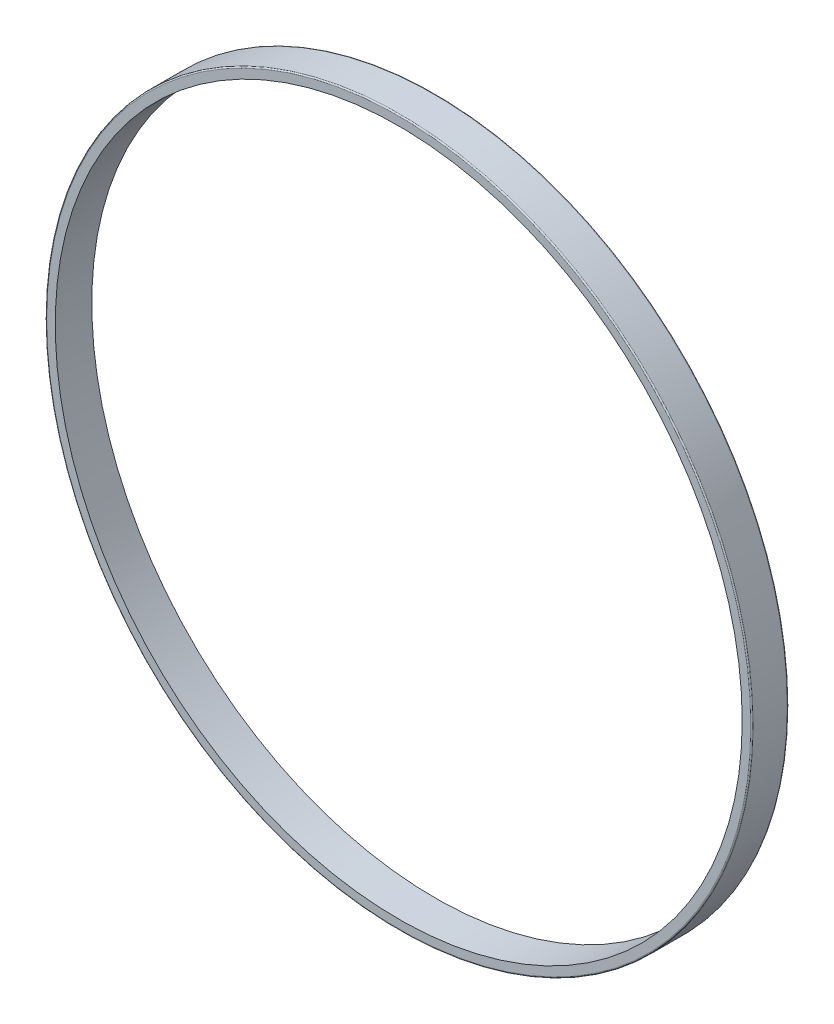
ISO-10303-21;
HEADER;
FILE_DESCRIPTION(('STEP AP214'),'2;1');
FILE_NAME('part.step','',(''),(''),'','','');
FILE_SCHEMA(('AUTOMOTIVE_DESIGN { 1 0 10303 214 1 1 1 1 }'));
ENDSEC;
DATA;
#1=APPLICATION_CONTEXT('core data for automotive mechanical design processes');
#2=APPLICATION_PROTOCOL_DEFINITION('international standard','automotive_design',2000,#1);
#3=PRODUCT_CONTEXT('',#1,'mechanical');
#4=PRODUCT('Part','Part','',(#3));
#5=PRODUCT_RELATED_PRODUCT_CATEGORY('part','',(#4));
#6=PRODUCT_DEFINITION_FORMATION('','',#4);
#7=PRODUCT_DEFINITION_CONTEXT('part definition',#1,'design');
#8=PRODUCT_DEFINITION('design','',#6,#7);
#9=PRODUCT_DEFINITION_SHAPE('','',#8);
#10=(LENGTH_UNIT() NAMED_UNIT(*) SI_UNIT(.MILLI.,.METRE.));
#11=(NAMED_UNIT(*) PLANE_ANGLE_UNIT() SI_UNIT($,.RADIAN.));
#12=(NAMED_UNIT(*) SI_UNIT($,.STERADIAN.) SOLID_ANGLE_UNIT());
#13=UNCERTAINTY_MEASURE_WITH_UNIT(LENGTH_MEASURE(1.E-05),#10,'distance_accuracy_value','');
#14=(GEOMETRIC_REPRESENTATION_CONTEXT(3) GLOBAL_UNCERTAINTY_ASSIGNED_CONTEXT((#13)) GLOBAL_UNIT_ASSIGNED_CONTEXT((#10,
#11,#12)) REPRESENTATION_CONTEXT('',''));
#15=CARTESIAN_POINT('',(0.,0.,0.));
#16=DIRECTION('',(0.,0.,1.));
#17=DIRECTION('',(1.,0.,0.));
#18=AXIS2_PLACEMENT_3D('',#15,#16,#17);
#19=CARTESIAN_POINT('',(0.,0.,6.));
#20=DIRECTION('',(0.,0.,1.));
#21=DIRECTION('',(1.,0.,0.));
#22=AXIS2_PLACEMENT_3D('',#19,#20,#21);
#23=PLANE('',#22);
#24=CARTESIAN_POINT('',(0.,0.,6.));
#25=DIRECTION('',(0.,0.,1.));
#26=DIRECTION('',(1.,0.,0.));
#27=AXIS2_PLACEMENT_3D('',#24,#25,#26);
#28=CIRCLE('',#27,57.8);
#29=CARTESIAN_POINT('',(57.8,0.,6.));
#30=VERTEX_POINT('',#29);
#31=EDGE_CURVE('E10',#30,#30,#28,.T.);
#32=ORIENTED_EDGE('',*,*,#31,.T.);
#33=EDGE_LOOP('',(#32));
#34=FACE_BOUND('',#33,.T.);
#35=CARTESIAN_POINT('',(0.,0.,6.));
#36=DIRECTION('',(0.,0.,1.));
#37=DIRECTION('',(1.,0.,0.));
#38=AXIS2_PLACEMENT_3D('',#35,#36,#37);
#39=CIRCLE('',#38,56.4);
#40=CARTESIAN_POINT('',(56.4,0.,6.));
#41=VERTEX_POINT('',#40);
#42=EDGE_CURVE('E53',#41,#41,#39,.T.);
#43=ORIENTED_EDGE('',*,*,#42,.F.);
#44=EDGE_LOOP('',(#43));
#45=FACE_BOUND('',#44,.T.);
#46=ADVANCED_FACE('F33',(#34,#45),#23,.T.);
#47=CARTESIAN_POINT('',(0.,0.,0.));
#48=DIRECTION('',(0.,0.,1.));
#49=DIRECTION('',(1.,0.,0.));
#50=AXIS2_PLACEMENT_3D('',#47,#48,#49);
#51=PLANE('',#50);
#52=CARTESIAN_POINT('',(0.,0.,0.));
#53=DIRECTION('',(0.,0.,1.));
#54=DIRECTION('',(1.,0.,0.));
#55=AXIS2_PLACEMENT_3D('',#52,#53,#54);
#56=CIRCLE('',#55,57.8);
#57=CARTESIAN_POINT('',(57.8,0.,0.));
#58=VERTEX_POINT('',#57);
#59=EDGE_CURVE('E40',#58,#58,#56,.F.);
#60=ORIENTED_EDGE('',*,*,#59,.T.);
#61=EDGE_LOOP('',(#60));
#62=FACE_BOUND('',#61,.T.);
#63=CARTESIAN_POINT('',(0.,0.,0.));
#64=DIRECTION('',(0.,0.,1.));
#65=DIRECTION('',(1.,0.,0.));
#66=AXIS2_PLACEMENT_3D('',#63,#64,#65);
#67=CIRCLE('',#66,56.4);
#68=CARTESIAN_POINT('',(56.4,0.,0.));
#69=VERTEX_POINT('',#68);
#70=EDGE_CURVE('E54',#69,#69,#67,.T.);
#71=ORIENTED_EDGE('',*,*,#70,.T.);
#72=EDGE_LOOP('',(#71));
#73=FACE_BOUND('',#72,.T.);
#74=ADVANCED_FACE('F64',(#62,#73),#51,.F.);
#75=CARTESIAN_POINT('',(0.,0.,6.));
#76=DIRECTION('',(0.,0.,-1.));
#77=DIRECTION('',(-1.,0.,0.));
#78=AXIS2_PLACEMENT_3D('',#75,#76,#77);
#79=CYLINDRICAL_SURFACE('',#78,58.);
#80=CARTESIAN_POINT('',(0.,0.,0.2));
#81=DIRECTION('',(0.,0.,1.));
#82=DIRECTION('',(1.,0.,0.));
#83=AXIS2_PLACEMENT_3D('',#80,#81,#82);
#84=CIRCLE('',#83,58.);
#85=CARTESIAN_POINT('',(58.,0.,0.2));
#86=VERTEX_POINT('',#85);
#87=EDGE_CURVE('E44',#86,#86,#84,.T.);
#88=ORIENTED_EDGE('',*,*,#87,.T.);
#89=EDGE_LOOP('',(#88));
#90=FACE_BOUND('',#89,.T.);
#91=CARTESIAN_POINT('',(0.,0.,5.8));
#92=DIRECTION('',(0.,0.,1.));
#93=DIRECTION('',(1.,0.,0.));
#94=AXIS2_PLACEMENT_3D('',#91,#92,#93);
#95=CIRCLE('',#94,58.);
#96=CARTESIAN_POINT('',(58.,0.,5.8));
#97=VERTEX_POINT('',#96);
#98=EDGE_CURVE('E48',#97,#97,#95,.F.);
#99=ORIENTED_EDGE('',*,*,#98,.T.);
#100=EDGE_LOOP('',(#99));
#101=FACE_BOUND('',#100,.T.);
#102=ADVANCED_FACE('F69',(#90,#101),#79,.T.);
#103=CARTESIAN_POINT('',(0.,0.,6.));
#104=DIRECTION('',(0.,0.,-1.));
#105=DIRECTION('',(-1.,0.,0.));
#106=AXIS2_PLACEMENT_3D('',#103,#104,#105);
#107=CYLINDRICAL_SURFACE('',#106,56.4);
#108=ORIENTED_EDGE('',*,*,#42,.T.);
#109=EDGE_LOOP('',(#108));
#110=FACE_BOUND('',#109,.T.);
#111=ORIENTED_EDGE('',*,*,#70,.F.);
#112=EDGE_LOOP('',(#111));
#113=FACE_BOUND('',#112,.T.);
#114=ADVANCED_FACE('F60',(#110,#113),#107,.F.);
#115=CARTESIAN_POINT('',(0.,0.,0.2));
#116=DIRECTION('',(0.,0.,1.));
#117=DIRECTION('',(1.,0.,0.));
#118=AXIS2_PLACEMENT_3D('',#115,#116,#117);
#119=TOROIDAL_SURFACE('',#118,57.8,0.2);
#120=ORIENTED_EDGE('',*,*,#59,.F.);
#121=EDGE_LOOP('',(#120));
#122=FACE_BOUND('',#121,.T.);
#123=ORIENTED_EDGE('',*,*,#87,.F.);
#124=EDGE_LOOP('',(#123));
#125=FACE_BOUND('',#124,.T.);
#126=ADVANCED_FACE('F75',(#122,#125),#119,.T.);
#127=CARTESIAN_POINT('',(0.,0.,5.8));
#128=DIRECTION('',(0.,0.,1.));
#129=DIRECTION('',(1.,0.,0.));
#130=AXIS2_PLACEMENT_3D('',#127,#128,#129);
#131=TOROIDAL_SURFACE('',#130,57.8,0.2);
#132=ORIENTED_EDGE('',*,*,#98,.F.);
#133=EDGE_LOOP('',(#132));
#134=FACE_BOUND('',#133,.T.);
#135=ORIENTED_EDGE('',*,*,#31,.F.);
#136=EDGE_LOOP('',(#135));
#137=FACE_BOUND('',#136,.T.);
#138=ADVANCED_FACE('F35',(#134,#137),#131,.T.);
#139=CLOSED_SHELL('',(#46,#74,#102,#114,#126,#138));
#140=MANIFOLD_SOLID_BREP('B2',#139);
#141=ADVANCED_BREP_SHAPE_REPRESENTATION('',(#18,#140),#14);
#142=SHAPE_DEFINITION_REPRESENTATION(#9,#141);
ENDSEC;
END-ISO-10303-21;
